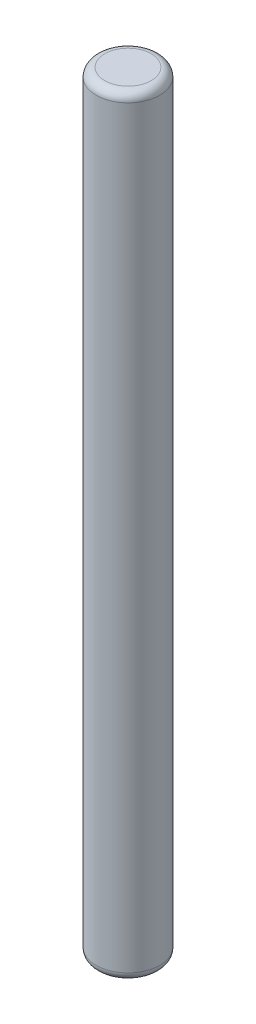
ISO-10303-21;
HEADER;
FILE_DESCRIPTION(('STEP AP214'),'2;1');
FILE_NAME('part.step','',(''),(''),'','','');
FILE_SCHEMA(('AUTOMOTIVE_DESIGN { 1 0 10303 214 1 1 1 1 }'));
ENDSEC;
DATA;
#1=APPLICATION_CONTEXT('core data for automotive mechanical design processes');
#2=APPLICATION_PROTOCOL_DEFINITION('international standard','automotive_design',2000,#1);
#3=PRODUCT_CONTEXT('',#1,'mechanical');
#4=PRODUCT('Part','Part','',(#3));
#5=PRODUCT_RELATED_PRODUCT_CATEGORY('part','',(#4));
#6=PRODUCT_DEFINITION_FORMATION('','',#4);
#7=PRODUCT_DEFINITION_CONTEXT('part definition',#1,'design');
#8=PRODUCT_DEFINITION('design','',#6,#7);
#9=PRODUCT_DEFINITION_SHAPE('','',#8);
#10=(LENGTH_UNIT() NAMED_UNIT(*) SI_UNIT(.MILLI.,.METRE.));
#11=(NAMED_UNIT(*) PLANE_ANGLE_UNIT() SI_UNIT($,.RADIAN.));
#12=(NAMED_UNIT(*) SI_UNIT($,.STERADIAN.) SOLID_ANGLE_UNIT());
#13=UNCERTAINTY_MEASURE_WITH_UNIT(LENGTH_MEASURE(1.E-05),#10,'distance_accuracy_value','');
#14=(GEOMETRIC_REPRESENTATION_CONTEXT(3) GLOBAL_UNCERTAINTY_ASSIGNED_CONTEXT((#13)) GLOBAL_UNIT_ASSIGNED_CONTEXT((#10,
#11,#12)) REPRESENTATION_CONTEXT('',''));
#15=CARTESIAN_POINT('',(0.,0.,0.));
#16=DIRECTION('',(0.,0.,1.));
#17=DIRECTION('',(1.,0.,0.));
#18=AXIS2_PLACEMENT_3D('',#15,#16,#17);
#19=CARTESIAN_POINT('',(0.,9.1,0.));
#20=DIRECTION('',(0.,-1.,0.));
#21=DIRECTION('',(0.,0.,-1.));
#22=AXIS2_PLACEMENT_3D('',#19,#20,#21);
#23=CYLINDRICAL_SURFACE('',#22,0.375);
#24=CARTESIAN_POINT('',(0.,0.0999999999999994,0.));
#25=DIRECTION('',(0.,1.,0.));
#26=DIRECTION('',(0.,0.,1.));
#27=AXIS2_PLACEMENT_3D('',#24,#25,#26);
#28=CIRCLE('',#27,0.375);
#29=CARTESIAN_POINT('',(0.,0.0999999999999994,0.375));
#30=VERTEX_POINT('',#29);
#31=EDGE_CURVE('E43',#30,#30,#28,.T.);
#32=ORIENTED_EDGE('',*,*,#31,.T.);
#33=EDGE_LOOP('',(#32));
#34=FACE_BOUND('',#33,.T.);
#35=CARTESIAN_POINT('',(0.,9.,0.));
#36=DIRECTION('',(0.,1.,0.));
#37=DIRECTION('',(0.,0.,1.));
#38=AXIS2_PLACEMENT_3D('',#35,#36,#37);
#39=CIRCLE('',#38,0.375);
#40=CARTESIAN_POINT('',(0.,9.,0.375));
#41=VERTEX_POINT('',#40);
#42=EDGE_CURVE('E47',#41,#41,#39,.F.);
#43=ORIENTED_EDGE('',*,*,#42,.T.);
#44=EDGE_LOOP('',(#43));
#45=FACE_BOUND('',#44,.T.);
#46=ADVANCED_FACE('F32',(#34,#45),#23,.T.);
#47=CARTESIAN_POINT('',(0.,9.1,0.));
#48=DIRECTION('',(0.,1.,0.));
#49=DIRECTION('',(0.,0.,1.));
#50=AXIS2_PLACEMENT_3D('',#47,#48,#49);
#51=PLANE('',#50);
#52=CARTESIAN_POINT('',(0.,9.1,0.));
#53=DIRECTION('',(0.,1.,0.));
#54=DIRECTION('',(0.,0.,1.));
#55=AXIS2_PLACEMENT_3D('',#52,#53,#54);
#56=CIRCLE('',#55,0.275);
#57=CARTESIAN_POINT('',(0.,9.1,0.275));
#58=VERTEX_POINT('',#57);
#59=EDGE_CURVE('E10',#58,#58,#56,.T.);
#60=ORIENTED_EDGE('',*,*,#59,.T.);
#61=EDGE_LOOP('',(#60));
#62=FACE_BOUND('',#61,.T.);
#63=ADVANCED_FACE('F63',(#62),#51,.T.);
#64=CARTESIAN_POINT('',(0.,0.,0.));
#65=DIRECTION('',(0.,1.,0.));
#66=DIRECTION('',(0.,0.,1.));
#67=AXIS2_PLACEMENT_3D('',#64,#65,#66);
#68=PLANE('',#67);
#69=CARTESIAN_POINT('',(0.,0.,0.));
#70=DIRECTION('',(0.,1.,0.));
#71=DIRECTION('',(0.,0.,1.));
#72=AXIS2_PLACEMENT_3D('',#69,#70,#71);
#73=CIRCLE('',#72,0.275);
#74=CARTESIAN_POINT('',(0.,0.,0.275));
#75=VERTEX_POINT('',#74);
#76=EDGE_CURVE('E39',#75,#75,#73,.F.);
#77=ORIENTED_EDGE('',*,*,#76,.T.);
#78=EDGE_LOOP('',(#77));
#79=FACE_BOUND('',#78,.T.);
#80=ADVANCED_FACE('F60',(#79),#68,.F.);
#81=CARTESIAN_POINT('',(0.,0.0999999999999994,0.));
#82=DIRECTION('',(0.,1.,0.));
#83=DIRECTION('',(0.,0.,1.));
#84=AXIS2_PLACEMENT_3D('',#81,#82,#83);
#85=TOROIDAL_SURFACE('',#84,0.275,0.1);
#86=ORIENTED_EDGE('',*,*,#76,.F.);
#87=EDGE_LOOP('',(#86));
#88=FACE_BOUND('',#87,.T.);
#89=ORIENTED_EDGE('',*,*,#31,.F.);
#90=EDGE_LOOP('',(#89));
#91=FACE_BOUND('',#90,.T.);
#92=ADVANCED_FACE('F56',(#88,#91),#85,.T.);
#93=CARTESIAN_POINT('',(0.,9.,0.));
#94=DIRECTION('',(0.,1.,0.));
#95=DIRECTION('',(0.,0.,1.));
#96=AXIS2_PLACEMENT_3D('',#93,#94,#95);
#97=TOROIDAL_SURFACE('',#96,0.275,0.1);
#98=ORIENTED_EDGE('',*,*,#42,.F.);
#99=EDGE_LOOP('',(#98));
#100=FACE_BOUND('',#99,.T.);
#101=ORIENTED_EDGE('',*,*,#59,.F.);
#102=EDGE_LOOP('',(#101));
#103=FACE_BOUND('',#102,.T.);
#104=ADVANCED_FACE('F34',(#100,#103),#97,.T.);
#105=CLOSED_SHELL('',(#46,#63,#80,#92,#104));
#106=MANIFOLD_SOLID_BREP('B2',#105);
#107=ADVANCED_BREP_SHAPE_REPRESENTATION('',(#18,#106),#14);
#108=SHAPE_DEFINITION_REPRESENTATION(#9,#107);
ENDSEC;
END-ISO-10303-21;
